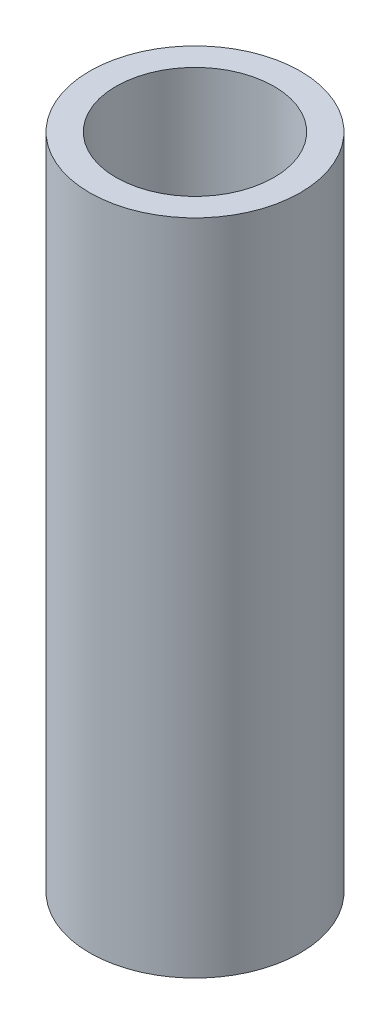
from build123d import *

# Parameters (mm, degrees)
ESQUISSE1_R      = 8
ESQUISSE1_R_2    = 6
EXTRUSION1_DEPTH = 50


with BuildPart() as part:
    # Esquisse1 → Extrusion1 (new body)
    with BuildSketch(Plane(origin=(0, 0, 0), x_dir=(1, 0, 0), z_dir=(0, 1, 0))):
        with Locations(Location((0, 0, 0), (0, 0, 270))):
            Circle(ESQUISSE1_R)
        with Locations(Location((0, 0, 0), (0, 0, 270))):
            Circle(ESQUISSE1_R_2, mode=Mode.SUBTRACT)
    extrude(amount=-EXTRUSION1_DEPTH)


solid = part.part
